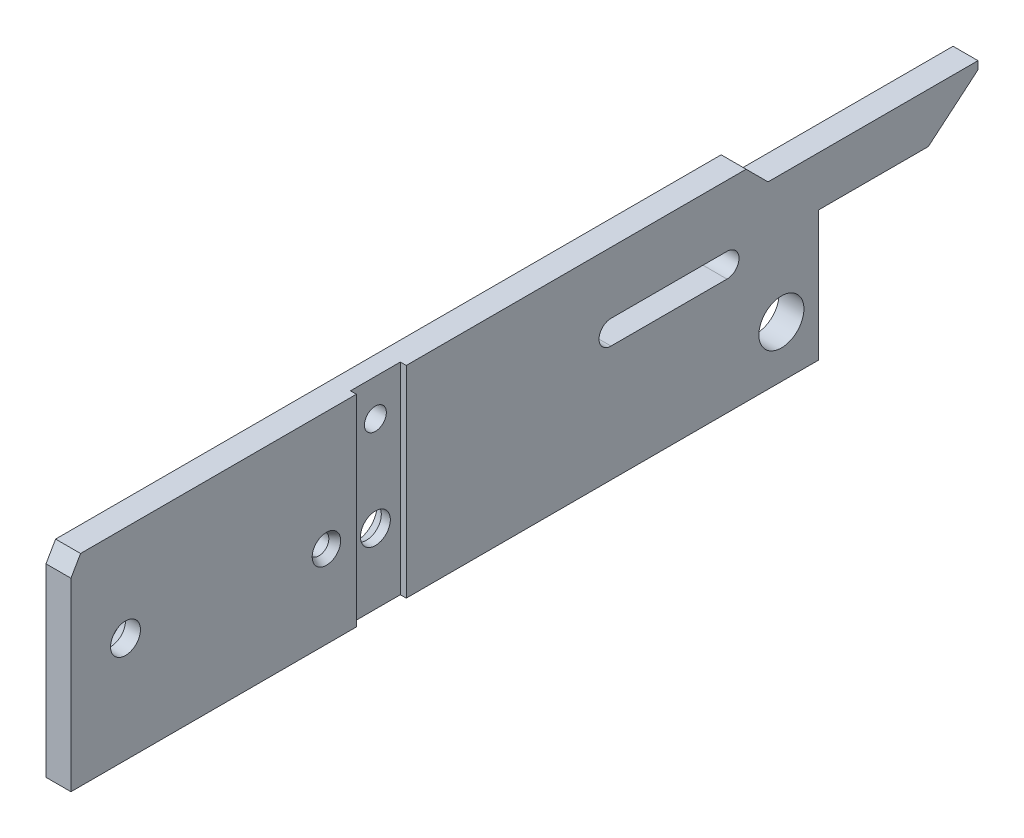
from build123d import *
from OCP.BRepFilletAPI import BRepFilletAPI_MakeChamfer

# Parameters (mm, degrees)
SKETCH_1_R          = 3.57505
SKETCH_1_R_2        = 2.3749
SKETCH_1_R_3        = 1.7399
SKETCH_1_R_4        = 1.5748
EXTRUDE_1_DEPTH     = 3.9624
SKETCH_2_W          = 7.9248
SKETCH_2_H          = 32.004
CUT_EXTRUDE_1_DEPTH = 0.9398
CHAMFER_1_SIZE      = 1.5875
CHAMFER_1_SIZE2     = 0.916543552
CHAMFER_2_SIZE      = 1.190625
CHAMFER_2_SIZE2     = 0.687407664


with BuildPart() as part:
    # Sketch 1 → Extrude 1 (new body)
    with BuildSketch(Plane(origin=(0, 0, 0), x_dir=(0, 0, -1), z_dir=(1, 0, 0))):
        Polygon((-112.8014, -8.2042), (5.9182, -8.2042), (5.9182, 12.446), (23.328373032, 12.446), (31.2166, 19.06500834), (31.2166, 20.32), (-2.1209, 20.32), (-5.6007, 23.7998), (-111.2774, 23.7998), (-112.8014, 21.160154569), align=None)
        Circle(SKETCH_1_R, mode=Mode.SUBTRACT)
        with Locations((-63.5254, 2.921)):
            Circle(SKETCH_1_R_2, mode=Mode.SUBTRACT)
        with Locations((-63.5254, 17.9832)):
            Circle(SKETCH_1_R_3, mode=Mode.SUBTRACT)
        with Locations((-72.2376, 4.9276)):
            Circle(SKETCH_1_R_4, mode=Mode.SUBTRACT)
        with Locations((-104.14, 8.5852)):
            Circle(SKETCH_1_R_2, mode=Mode.SUBTRACT)
        with BuildLine():
            Line((-27.051, 14.0208), (-8.636, 14.0208))
            ThreePointArc((-8.636, 14.0208), (-6.731, 12.1158), (-8.636, 10.2108))
            Line((-8.636, 10.2108), (-27.051, 10.2108))
            ThreePointArc((-27.051, 10.2108), (-28.956, 12.1158), (-27.051, 14.0208))
        make_face(mode=Mode.SUBTRACT)
    extrude(amount=EXTRUDE_1_DEPTH)

    # Sketch 2 → Cut-Extrude 1 (cut)
    with BuildSketch(Plane(origin=(3.9624, 0, 0), x_dir=(0, 0, -1), z_dir=(1, 0, 0))):
        with Locations((-63.5254, 7.7978)):
            Rectangle(SKETCH_2_W, SKETCH_2_H)
    extrude(amount=-CUT_EXTRUDE_1_DEPTH, mode=Mode.SUBTRACT)

    # Chamfer 1: one chamfer whose edges measure the first distance from different faces: ONE call of the kernel's chamfer builder (chamfer() names one face for all edges)
    chamfer_1_edges_1 = [part.edges().sort_by_distance(p)[0] for p in [
        (0, 2.921, 65.9003),
    ]]
    chamfer_1_side_1 = [part.faces().sort_by_distance(p)[0] for p in [
        (1.5113, 2.921, 65.9003),
    ]]
    chamfer_1_edges_2 = [part.edges().sort_by_distance(p)[0] for p in [
        (0, 8.5852, 106.5149),
    ]]
    chamfer_1_side_2 = [part.faces().sort_by_distance(p)[0] for p in [
        (1.9812, 8.5852, 106.5149),
    ]]
    chamfer_1 = BRepFilletAPI_MakeChamfer(part.part.solid().wrapped)
    for e in chamfer_1_edges_1:
        chamfer_1.Add(CHAMFER_1_SIZE, CHAMFER_1_SIZE2, e.wrapped, chamfer_1_side_1[0].wrapped)  # the first distance lies on this face
    for e in chamfer_1_edges_2:
        chamfer_1.Add(CHAMFER_1_SIZE, CHAMFER_1_SIZE2, e.wrapped, chamfer_1_side_2[0].wrapped)  # the first distance lies on this face
    add(Compound.cast(chamfer_1.Shape()), mode=Mode.REPLACE)

    # Chamfer 2
    chamfer_2_edges = [part.edges().sort_by_distance(p)[0] for p in [
        (3.9624, 4.9276, 73.8124),
    ]]
    chamfer_2_side = [part.faces().sort_by_distance(p)[0] for p in [
        (1.9812, 4.9276, 73.8124),
    ]]
    chamfer(chamfer_2_edges, length=CHAMFER_2_SIZE, length2=CHAMFER_2_SIZE2, reference=chamfer_2_side[0])


solid = part.part
